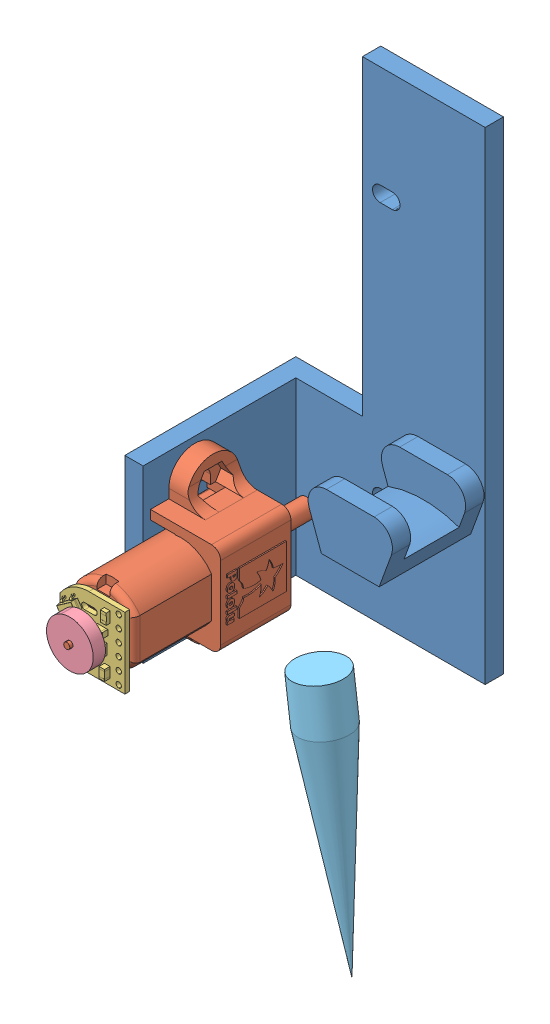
SolidWorks assembly Assem-GC.SLDASM, configuration Default (file format 14000). Lengths in mm.
Overall size (39.04 83.1 48.5).
9 component instances, 8 part files, 11 mates.
Components (placement in the parent):
- GC-sheath holder-1: GC-sheath holder.SLDPRT [Default] at (-30.5459 -8.5889 39.8961) size (34 79 28)
- catheter-holder-1: catheter-holder.SLDPRT [Default] at (-50.8749 -46.1837 50.3461) x (0 0 1) z (0.129825 -0.991537 0) size (8.9 26.49 45)
- catheter-roller-1: catheter-roller.SLDPRT [Default] at (-56.5459 -73.845 54.7961) x (-0.090274 0.995917 0) z (-0.995917 -0.090274 0) size (10 11.9 10)
- Assem-motor-1: Assem-motor.SLDASM [Default] at (-38.5459 -88.1748 98.8028) x (0 1 0) z (0 0 1) size (26.51 11.71 39.27)
  - motor dual shaft-1: motor dual shaft.SLDPRT [Default] at (14.3298 18 -34.4067) x (0 0 -1) z (-1 0 0) size (39.27 11.71 26.51)
  - motor-encoder1-1: motor-encoder1.SLDPRT [Default] at (14.3298 18 -17.9067) size (11.6 10.6 1.99)
  - motor-encoder2-1: motor-encoder2.SLDPRT [Default] at (14.3298 18 -13.9167) x (-0.923728 -0.383049 0) z (0 0 -1) size (7.65 7.65 2)
- needle-gear rack-1: needle-gear rack.SLDPRT [2485N243] at (-43.6387 -58.5889 32.3961) x (0 -1 0) z (0 0 1) size (79 17 3)
- GC-cone-1: GC-cone.SLDPRT [Default] at (-49.3143 -98.9275 50.3461) x (0.802963 0.105134 -0.586683) z (0.581718 0.076166 0.809817) size (8 41.5 8) (hidden)
Mates (geometry in assembly coordinates):
- Concentric1: concentric anti-aligned: cylinder of GC-sheath holder-1 through (-37.6314 -80.404 54.8961) axis (0 0 -1) radius 17; cylinder of catheter-holder-1 through (-37.6314 -80.404 26.9857) axis (0 0 1) radius 17
- Concentric2: concentric anti-aligned: cylinder of catheter-roller-1 through (-56.5459 -73.845 54.7961) axis (0 0 -1) radius 1.6; cylinder of Assem-motor-1/motor dual shaft-1 through (-56.5459 -73.845 45.3961) axis (0 0 1) radius 1.5
- Coincident6: coincident anti-aligned: plane of catheter-roller-1 through (-56.5459 -73.845 54.7961) normal (0 0 1); plane of Assem-motor-1/motor dual shaft-1 through (-56.5459 -73.845 54.7961) normal (0 0 -1)
- Coincident7: coincident anti-aligned: plane of GC-sheath holder-1 through (-61.5459 -59.5889 67.8961) normal (1 0 0); plane of Assem-motor-1/motor dual shaft-1 through (-61.5459 -77.1616 79.3961) normal (-1 0 0)
- Coincident8: coincident anti-aligned: plane of GC-sheath holder-1 through (-30.5459 -8.5889 42.8961) normal (0 0 1); plane of catheter-roller-1 through (-56.5459 -73.845 42.8961) normal (0 0 -1)
- Coincident9: coincident anti-aligned: plane of GC-sheath holder-1 through (-33.7265 -60.904 45.8961) normal (0 0 1); plane of catheter-holder-1 through (-45.0328 -90.8029 45.8961) normal (0 0 -1)
- Coincident11: coincident anti-aligned: plane of GC-sheath holder-1 through (-30.5459 -8.5889 39.8961) normal (0 0 -1); plane of needle-gear rack-1 through (-43.6387 -58.5889 39.8961) normal (0 0 1)
- Coincident14: coincident aligned: plane of GC-sheath holder-1 through (-50.6387 -8.5889 32.8961) normal (-1 0 0); plane of needle-gear rack-1 through (-50.6387 -58.5889 32.3961) normal (-1 0 0)
- Coincident15: coincident aligned: plane of GC-sheath holder-1 through (-64.5459 -8.5889 42.8961) normal (0 1 0); plane of needle-gear rack-1 through (-33.6387 -8.5889 24.8961) normal (0 1 0)
- Coincident16: coincident anti-aligned: plane of catheter-holder-1 through (-45.0328 -90.8029 50.3461) normal (0.129825 -0.991537 0); plane of GC-cone-1 through (-50.2879 -91.491 50.3461) normal (-0.129825 0.991537 0)
- Coincident17: coincident aligned: line of catheter-holder-1 through (-52.0729 -77.8587 50.3461) axis (0.129825 -0.991537 0); line of GC-cone-1 through (-49.3143 -98.9275 50.3461) axis (0.129825 -0.991537 0)
